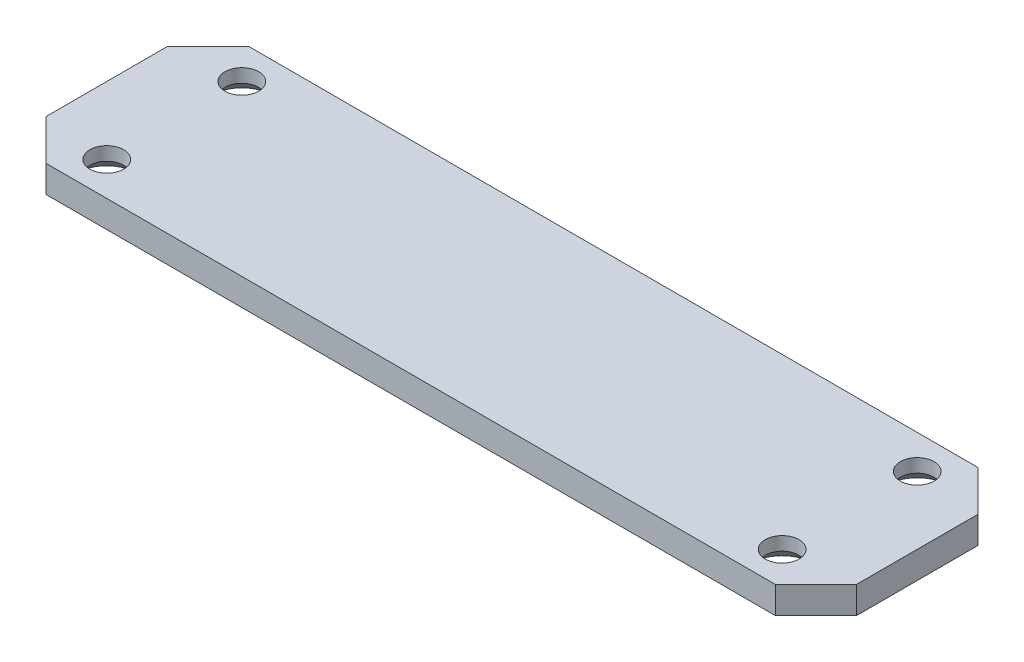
ISO-10303-21;
HEADER;
FILE_DESCRIPTION(('STEP AP214'),'2;1');
FILE_NAME('part.step','',(''),(''),'','','');
FILE_SCHEMA(('AUTOMOTIVE_DESIGN { 1 0 10303 214 1 1 1 1 }'));
ENDSEC;
DATA;
#1=APPLICATION_CONTEXT('core data for automotive mechanical design processes');
#2=APPLICATION_PROTOCOL_DEFINITION('international standard','automotive_design',2000,#1);
#3=PRODUCT_CONTEXT('',#1,'mechanical');
#4=PRODUCT('Part','Part','',(#3));
#5=PRODUCT_RELATED_PRODUCT_CATEGORY('part','',(#4));
#6=PRODUCT_DEFINITION_FORMATION('','',#4);
#7=PRODUCT_DEFINITION_CONTEXT('part definition',#1,'design');
#8=PRODUCT_DEFINITION('design','',#6,#7);
#9=PRODUCT_DEFINITION_SHAPE('','',#8);
#10=(LENGTH_UNIT() NAMED_UNIT(*) SI_UNIT(.MILLI.,.METRE.));
#11=(NAMED_UNIT(*) PLANE_ANGLE_UNIT() SI_UNIT($,.RADIAN.));
#12=(NAMED_UNIT(*) SI_UNIT($,.STERADIAN.) SOLID_ANGLE_UNIT());
#13=UNCERTAINTY_MEASURE_WITH_UNIT(LENGTH_MEASURE(1.E-05),#10,'distance_accuracy_value','');
#14=(GEOMETRIC_REPRESENTATION_CONTEXT(3) GLOBAL_UNCERTAINTY_ASSIGNED_CONTEXT((#13)) GLOBAL_UNIT_ASSIGNED_CONTEXT((#10,
#11,#12)) REPRESENTATION_CONTEXT('',''));
#15=CARTESIAN_POINT('',(0.,0.,0.));
#16=DIRECTION('',(0.,0.,1.));
#17=DIRECTION('',(1.,0.,0.));
#18=AXIS2_PLACEMENT_3D('',#15,#16,#17);
#19=CARTESIAN_POINT('',(-50.,-148.,8.));
#20=DIRECTION('',(0.,1.,0.));
#21=DIRECTION('',(0.,0.,1.));
#22=AXIS2_PLACEMENT_3D('',#19,#20,#21);
#23=CYLINDRICAL_SURFACE('',#22,2.5);
#24=CARTESIAN_POINT('',(-50.,-146.,8.));
#25=DIRECTION('',(0.,1.,0.));
#26=DIRECTION('',(0.,0.,1.));
#27=AXIS2_PLACEMENT_3D('',#24,#25,#26);
#28=CIRCLE('',#27,2.5);
#29=CARTESIAN_POINT('',(-50.,-146.,10.5));
#30=VERTEX_POINT('',#29);
#31=EDGE_CURVE('E11',#30,#30,#28,.F.);
#32=ORIENTED_EDGE('',*,*,#31,.T.);
#33=EDGE_LOOP('',(#32));
#34=FACE_BOUND('',#33,.T.);
#35=CARTESIAN_POINT('',(-50.,-144.,8.));
#36=DIRECTION('',(0.,1.,0.));
#37=DIRECTION('',(0.,0.,1.));
#38=AXIS2_PLACEMENT_3D('',#35,#36,#37);
#39=CIRCLE('',#38,2.5);
#40=CARTESIAN_POINT('',(-50.,-144.,10.5));
#41=VERTEX_POINT('',#40);
#42=EDGE_CURVE('E193',#41,#41,#39,.T.);
#43=ORIENTED_EDGE('',*,*,#42,.T.);
#44=EDGE_LOOP('',(#43));
#45=FACE_BOUND('',#44,.T.);
#46=ADVANCED_FACE('F16',(#34,#45),#23,.F.);
#47=CARTESIAN_POINT('',(50.,-148.,8.));
#48=DIRECTION('',(0.,1.,0.));
#49=DIRECTION('',(0.,0.,1.));
#50=AXIS2_PLACEMENT_3D('',#47,#48,#49);
#51=CYLINDRICAL_SURFACE('',#50,2.5);
#52=CARTESIAN_POINT('',(50.,-146.,8.));
#53=DIRECTION('',(0.,1.,0.));
#54=DIRECTION('',(0.,0.,1.));
#55=AXIS2_PLACEMENT_3D('',#52,#53,#54);
#56=CIRCLE('',#55,2.5);
#57=CARTESIAN_POINT('',(50.,-146.,10.5));
#58=VERTEX_POINT('',#57);
#59=EDGE_CURVE('E25',#58,#58,#56,.F.);
#60=ORIENTED_EDGE('',*,*,#59,.T.);
#61=EDGE_LOOP('',(#60));
#62=FACE_BOUND('',#61,.T.);
#63=CARTESIAN_POINT('',(50.,-144.,8.));
#64=DIRECTION('',(0.,1.,0.));
#65=DIRECTION('',(0.,0.,1.));
#66=AXIS2_PLACEMENT_3D('',#63,#64,#65);
#67=CIRCLE('',#66,2.5);
#68=CARTESIAN_POINT('',(50.,-144.,10.5));
#69=VERTEX_POINT('',#68);
#70=EDGE_CURVE('E196',#69,#69,#67,.T.);
#71=ORIENTED_EDGE('',*,*,#70,.T.);
#72=EDGE_LOOP('',(#71));
#73=FACE_BOUND('',#72,.T.);
#74=ADVANCED_FACE('F147',(#62,#73),#51,.F.);
#75=CARTESIAN_POINT('',(60.,-148.,33.));
#76=DIRECTION('',(0.,1.,0.));
#77=DIRECTION('',(0.,0.,1.));
#78=AXIS2_PLACEMENT_3D('',#75,#76,#77);
#79=PLANE('',#78);
#80=CARTESIAN_POINT('',(-50.,-148.,28.));
#81=DIRECTION('',(0.,1.,0.));
#82=DIRECTION('',(0.,0.,1.));
#83=AXIS2_PLACEMENT_3D('',#80,#81,#82);
#84=CIRCLE('',#83,4.5);
#85=CARTESIAN_POINT('',(-50.,-148.,32.5));
#86=VERTEX_POINT('',#85);
#87=EDGE_CURVE('E139',#86,#86,#84,.T.);
#88=ORIENTED_EDGE('',*,*,#87,.T.);
#89=EDGE_LOOP('',(#88));
#90=FACE_BOUND('',#89,.T.);
#91=CARTESIAN_POINT('',(50.,-148.,28.));
#92=DIRECTION('',(0.,1.,0.));
#93=DIRECTION('',(0.,0.,1.));
#94=AXIS2_PLACEMENT_3D('',#91,#92,#93);
#95=CIRCLE('',#94,4.5);
#96=CARTESIAN_POINT('',(50.,-148.,32.5));
#97=VERTEX_POINT('',#96);
#98=EDGE_CURVE('E136',#97,#97,#95,.T.);
#99=ORIENTED_EDGE('',*,*,#98,.T.);
#100=EDGE_LOOP('',(#99));
#101=FACE_BOUND('',#100,.T.);
#102=CARTESIAN_POINT('',(50.,-148.,8.));
#103=DIRECTION('',(0.,1.,0.));
#104=DIRECTION('',(0.,0.,1.));
#105=AXIS2_PLACEMENT_3D('',#102,#103,#104);
#106=CIRCLE('',#105,4.5);
#107=CARTESIAN_POINT('',(50.,-148.,12.5));
#108=VERTEX_POINT('',#107);
#109=EDGE_CURVE('E133',#108,#108,#106,.T.);
#110=ORIENTED_EDGE('',*,*,#109,.T.);
#111=EDGE_LOOP('',(#110));
#112=FACE_BOUND('',#111,.T.);
#113=CARTESIAN_POINT('',(-50.,-148.,8.));
#114=DIRECTION('',(0.,1.,0.));
#115=DIRECTION('',(0.,0.,1.));
#116=AXIS2_PLACEMENT_3D('',#113,#114,#115);
#117=CIRCLE('',#116,4.5);
#118=CARTESIAN_POINT('',(-50.,-148.,12.5));
#119=VERTEX_POINT('',#118);
#120=EDGE_CURVE('E129',#119,#119,#117,.T.);
#121=ORIENTED_EDGE('',*,*,#120,.T.);
#122=EDGE_LOOP('',(#121));
#123=FACE_BOUND('',#122,.T.);
#124=DIRECTION('',(-1.,0.,0.));
#125=VECTOR('',#124,1.);
#126=CARTESIAN_POINT('',(60.,-148.,3.));
#127=LINE('',#126,#125);
#128=CARTESIAN_POINT('',(54.,-148.,3.));
#129=VERTEX_POINT('',#128);
#130=CARTESIAN_POINT('',(-54.,-148.,3.));
#131=VERTEX_POINT('',#130);
#132=EDGE_CURVE('E163',#129,#131,#127,.T.);
#133=ORIENTED_EDGE('',*,*,#132,.F.);
#134=DIRECTION('',(-0.707106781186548,0.,-0.707106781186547));
#135=VECTOR('',#134,1.);
#136=CARTESIAN_POINT('',(54.,-148.,3.));
#137=LINE('',#136,#135);
#138=CARTESIAN_POINT('',(60.,-148.,9.));
#139=VERTEX_POINT('',#138);
#140=EDGE_CURVE('E164',#129,#139,#137,.F.);
#141=ORIENTED_EDGE('',*,*,#140,.T.);
#142=DIRECTION('',(0.,0.,-1.));
#143=VECTOR('',#142,1.);
#144=CARTESIAN_POINT('',(60.,-148.,33.));
#145=LINE('',#144,#143);
#146=CARTESIAN_POINT('',(60.,-148.,27.));
#147=VERTEX_POINT('',#146);
#148=EDGE_CURVE('E105',#147,#139,#145,.T.);
#149=ORIENTED_EDGE('',*,*,#148,.F.);
#150=DIRECTION('',(0.707106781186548,0.,-0.707106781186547));
#151=VECTOR('',#150,1.);
#152=CARTESIAN_POINT('',(60.,-148.,27.));
#153=LINE('',#152,#151);
#154=CARTESIAN_POINT('',(54.,-148.,33.));
#155=VERTEX_POINT('',#154);
#156=EDGE_CURVE('E178',#147,#155,#153,.F.);
#157=ORIENTED_EDGE('',*,*,#156,.T.);
#158=DIRECTION('',(1.,0.,0.));
#159=VECTOR('',#158,1.);
#160=CARTESIAN_POINT('',(-60.,-148.,33.));
#161=LINE('',#160,#159);
#162=CARTESIAN_POINT('',(-54.,-148.,33.));
#163=VERTEX_POINT('',#162);
#164=EDGE_CURVE('E170',#163,#155,#161,.T.);
#165=ORIENTED_EDGE('',*,*,#164,.F.);
#166=DIRECTION('',(0.707106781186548,0.,0.707106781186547));
#167=VECTOR('',#166,1.);
#168=CARTESIAN_POINT('',(-54.,-148.,33.));
#169=LINE('',#168,#167);
#170=CARTESIAN_POINT('',(-60.,-148.,27.));
#171=VERTEX_POINT('',#170);
#172=EDGE_CURVE('E180',#163,#171,#169,.F.);
#173=ORIENTED_EDGE('',*,*,#172,.T.);
#174=DIRECTION('',(0.,0.,1.));
#175=VECTOR('',#174,1.);
#176=CARTESIAN_POINT('',(-60.,-148.,3.));
#177=LINE('',#176,#175);
#178=CARTESIAN_POINT('',(-60.,-148.,9.));
#179=VERTEX_POINT('',#178);
#180=EDGE_CURVE('E167',#179,#171,#177,.T.);
#181=ORIENTED_EDGE('',*,*,#180,.F.);
#182=DIRECTION('',(-0.707106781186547,0.,0.707106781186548));
#183=VECTOR('',#182,1.);
#184=CARTESIAN_POINT('',(-60.,-148.,9.));
#185=LINE('',#184,#183);
#186=EDGE_CURVE('E61',#179,#131,#185,.F.);
#187=ORIENTED_EDGE('',*,*,#186,.T.);
#188=EDGE_LOOP('',(#133,#141,#149,#157,#165,#173,#181,#187));
#189=FACE_BOUND('',#188,.T.);
#190=ADVANCED_FACE('F156',(#90,#101,#112,#123,#189),#79,.F.);
#191=CARTESIAN_POINT('',(50.,-148.,28.));
#192=DIRECTION('',(0.,1.,0.));
#193=DIRECTION('',(0.,0.,1.));
#194=AXIS2_PLACEMENT_3D('',#191,#192,#193);
#195=CYLINDRICAL_SURFACE('',#194,2.5);
#196=CARTESIAN_POINT('',(50.,-146.,28.));
#197=DIRECTION('',(0.,1.,0.));
#198=DIRECTION('',(0.,0.,1.));
#199=AXIS2_PLACEMENT_3D('',#196,#197,#198);
#200=CIRCLE('',#199,2.5);
#201=CARTESIAN_POINT('',(50.,-146.,30.5));
#202=VERTEX_POINT('',#201);
#203=EDGE_CURVE('E142',#202,#202,#200,.F.);
#204=ORIENTED_EDGE('',*,*,#203,.T.);
#205=EDGE_LOOP('',(#204));
#206=FACE_BOUND('',#205,.T.);
#207=CARTESIAN_POINT('',(50.,-144.,28.));
#208=DIRECTION('',(0.,1.,0.));
#209=DIRECTION('',(0.,0.,1.));
#210=AXIS2_PLACEMENT_3D('',#207,#208,#209);
#211=CIRCLE('',#210,2.5);
#212=CARTESIAN_POINT('',(50.,-144.,30.5));
#213=VERTEX_POINT('',#212);
#214=EDGE_CURVE('E199',#213,#213,#211,.T.);
#215=ORIENTED_EDGE('',*,*,#214,.T.);
#216=EDGE_LOOP('',(#215));
#217=FACE_BOUND('',#216,.T.);
#218=ADVANCED_FACE('F159',(#206,#217),#195,.F.);
#219=CARTESIAN_POINT('',(-60.,-138.,33.));
#220=DIRECTION('',(0.,0.,-1.));
#221=DIRECTION('',(-1.,0.,0.));
#222=AXIS2_PLACEMENT_3D('',#219,#220,#221);
#223=PLANE('',#222);
#224=DIRECTION('',(1.,0.,0.));
#225=VECTOR('',#224,1.);
#226=CARTESIAN_POINT('',(-60.,-144.,33.));
#227=LINE('',#226,#225);
#228=CARTESIAN_POINT('',(-54.,-144.,33.));
#229=VERTEX_POINT('',#228);
#230=CARTESIAN_POINT('',(54.,-144.,33.));
#231=VERTEX_POINT('',#230);
#232=EDGE_CURVE('E113',#229,#231,#227,.T.);
#233=ORIENTED_EDGE('',*,*,#232,.F.);
#234=DIRECTION('',(0.,-1.,0.));
#235=VECTOR('',#234,1.);
#236=CARTESIAN_POINT('',(-54.,-138.,33.));
#237=LINE('',#236,#235);
#238=EDGE_CURVE('E130',#229,#163,#237,.T.);
#239=ORIENTED_EDGE('',*,*,#238,.T.);
#240=ORIENTED_EDGE('',*,*,#164,.T.);
#241=DIRECTION('',(0.,1.,0.));
#242=VECTOR('',#241,1.);
#243=CARTESIAN_POINT('',(54.,-138.,33.));
#244=LINE('',#243,#242);
#245=EDGE_CURVE('E89',#155,#231,#244,.T.);
#246=ORIENTED_EDGE('',*,*,#245,.T.);
#247=EDGE_LOOP('',(#233,#239,#240,#246));
#248=FACE_BOUND('',#247,.T.);
#249=ADVANCED_FACE('F214',(#248),#223,.F.);
#250=CARTESIAN_POINT('',(60.,-138.,33.));
#251=DIRECTION('',(-1.,0.,0.));
#252=DIRECTION('',(0.,0.,1.));
#253=AXIS2_PLACEMENT_3D('',#250,#251,#252);
#254=PLANE('',#253);
#255=ORIENTED_EDGE('',*,*,#148,.T.);
#256=DIRECTION('',(0.,1.,0.));
#257=VECTOR('',#256,1.);
#258=CARTESIAN_POINT('',(60.,-138.,9.));
#259=LINE('',#258,#257);
#260=CARTESIAN_POINT('',(60.,-144.,9.));
#261=VERTEX_POINT('',#260);
#262=EDGE_CURVE('E99',#139,#261,#259,.T.);
#263=ORIENTED_EDGE('',*,*,#262,.T.);
#264=DIRECTION('',(0.,0.,-1.));
#265=VECTOR('',#264,1.);
#266=CARTESIAN_POINT('',(60.,-144.,33.));
#267=LINE('',#266,#265);
#268=CARTESIAN_POINT('',(60.,-144.,27.));
#269=VERTEX_POINT('',#268);
#270=EDGE_CURVE('E102',#269,#261,#267,.T.);
#271=ORIENTED_EDGE('',*,*,#270,.F.);
#272=DIRECTION('',(0.,-1.,0.));
#273=VECTOR('',#272,1.);
#274=CARTESIAN_POINT('',(60.,-138.,27.));
#275=LINE('',#274,#273);
#276=EDGE_CURVE('E108',#269,#147,#275,.T.);
#277=ORIENTED_EDGE('',*,*,#276,.T.);
#278=EDGE_LOOP('',(#255,#263,#271,#277));
#279=FACE_BOUND('',#278,.T.);
#280=ADVANCED_FACE('F100',(#279),#254,.F.);
#281=CARTESIAN_POINT('',(60.,-138.,3.));
#282=DIRECTION('',(0.,0.,1.));
#283=DIRECTION('',(1.,0.,0.));
#284=AXIS2_PLACEMENT_3D('',#281,#282,#283);
#285=PLANE('',#284);
#286=DIRECTION('',(-1.,0.,0.));
#287=VECTOR('',#286,1.);
#288=CARTESIAN_POINT('',(60.,-144.,3.));
#289=LINE('',#288,#287);
#290=CARTESIAN_POINT('',(54.,-144.,3.));
#291=VERTEX_POINT('',#290);
#292=CARTESIAN_POINT('',(-54.,-144.,3.));
#293=VERTEX_POINT('',#292);
#294=EDGE_CURVE('E112',#291,#293,#289,.T.);
#295=ORIENTED_EDGE('',*,*,#294,.F.);
#296=DIRECTION('',(0.,-1.,0.));
#297=VECTOR('',#296,1.);
#298=CARTESIAN_POINT('',(54.,-138.,3.));
#299=LINE('',#298,#297);
#300=EDGE_CURVE('E118',#291,#129,#299,.T.);
#301=ORIENTED_EDGE('',*,*,#300,.T.);
#302=ORIENTED_EDGE('',*,*,#132,.T.);
#303=DIRECTION('',(0.,1.,0.));
#304=VECTOR('',#303,1.);
#305=CARTESIAN_POINT('',(-54.,-138.,3.));
#306=LINE('',#305,#304);
#307=EDGE_CURVE('E174',#131,#293,#306,.T.);
#308=ORIENTED_EDGE('',*,*,#307,.T.);
#309=EDGE_LOOP('',(#295,#301,#302,#308));
#310=FACE_BOUND('',#309,.T.);
#311=ADVANCED_FACE('F263',(#310),#285,.F.);
#312=CARTESIAN_POINT('',(-60.,-138.,3.));
#313=DIRECTION('',(1.,0.,0.));
#314=DIRECTION('',(0.,0.,-1.));
#315=AXIS2_PLACEMENT_3D('',#312,#313,#314);
#316=PLANE('',#315);
#317=DIRECTION('',(0.,0.,1.));
#318=VECTOR('',#317,1.);
#319=CARTESIAN_POINT('',(-60.,-144.,3.));
#320=LINE('',#319,#318);
#321=CARTESIAN_POINT('',(-60.,-144.,9.));
#322=VERTEX_POINT('',#321);
#323=CARTESIAN_POINT('',(-60.,-144.,27.));
#324=VERTEX_POINT('',#323);
#325=EDGE_CURVE('E176',#322,#324,#320,.T.);
#326=ORIENTED_EDGE('',*,*,#325,.F.);
#327=DIRECTION('',(0.,-1.,0.));
#328=VECTOR('',#327,1.);
#329=CARTESIAN_POINT('',(-60.,-138.,9.));
#330=LINE('',#329,#328);
#331=EDGE_CURVE('E121',#322,#179,#330,.T.);
#332=ORIENTED_EDGE('',*,*,#331,.T.);
#333=ORIENTED_EDGE('',*,*,#180,.T.);
#334=DIRECTION('',(0.,1.,0.));
#335=VECTOR('',#334,1.);
#336=CARTESIAN_POINT('',(-60.,-138.,27.));
#337=LINE('',#336,#335);
#338=EDGE_CURVE('E33',#171,#324,#337,.T.);
#339=ORIENTED_EDGE('',*,*,#338,.T.);
#340=EDGE_LOOP('',(#326,#332,#333,#339));
#341=FACE_BOUND('',#340,.T.);
#342=ADVANCED_FACE('F209',(#341),#316,.F.);
#343=CARTESIAN_POINT('',(60.,-144.,33.));
#344=DIRECTION('',(0.,1.,0.));
#345=DIRECTION('',(0.,0.,1.));
#346=AXIS2_PLACEMENT_3D('',#343,#344,#345);
#347=PLANE('',#346);
#348=CARTESIAN_POINT('',(-50.,-144.,28.));
#349=DIRECTION('',(0.,1.,0.));
#350=DIRECTION('',(0.,0.,1.));
#351=AXIS2_PLACEMENT_3D('',#348,#349,#350);
#352=CIRCLE('',#351,2.5);
#353=CARTESIAN_POINT('',(-50.,-144.,30.5));
#354=VERTEX_POINT('',#353);
#355=EDGE_CURVE('E190',#354,#354,#352,.T.);
#356=ORIENTED_EDGE('',*,*,#355,.F.);
#357=EDGE_LOOP('',(#356));
#358=FACE_BOUND('',#357,.T.);
#359=ORIENTED_EDGE('',*,*,#42,.F.);
#360=EDGE_LOOP('',(#359));
#361=FACE_BOUND('',#360,.T.);
#362=ORIENTED_EDGE('',*,*,#70,.F.);
#363=EDGE_LOOP('',(#362));
#364=FACE_BOUND('',#363,.T.);
#365=ORIENTED_EDGE('',*,*,#214,.F.);
#366=EDGE_LOOP('',(#365));
#367=FACE_BOUND('',#366,.T.);
#368=ORIENTED_EDGE('',*,*,#270,.T.);
#369=DIRECTION('',(0.707106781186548,0.,0.707106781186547));
#370=VECTOR('',#369,1.);
#371=CARTESIAN_POINT('',(72.,-144.,21.));
#372=LINE('',#371,#370);
#373=EDGE_CURVE('E52',#261,#291,#372,.F.);
#374=ORIENTED_EDGE('',*,*,#373,.T.);
#375=ORIENTED_EDGE('',*,*,#294,.T.);
#376=DIRECTION('',(0.707106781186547,0.,-0.707106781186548));
#377=VECTOR('',#376,1.);
#378=CARTESIAN_POINT('',(-12.,-144.,-39.));
#379=LINE('',#378,#377);
#380=EDGE_CURVE('E119',#293,#322,#379,.F.);
#381=ORIENTED_EDGE('',*,*,#380,.T.);
#382=ORIENTED_EDGE('',*,*,#325,.T.);
#383=DIRECTION('',(-0.707106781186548,0.,-0.707106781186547));
#384=VECTOR('',#383,1.);
#385=CARTESIAN_POINT('',(3.,-144.,90.));
#386=LINE('',#385,#384);
#387=EDGE_CURVE('E93',#324,#229,#386,.F.);
#388=ORIENTED_EDGE('',*,*,#387,.T.);
#389=ORIENTED_EDGE('',*,*,#232,.T.);
#390=DIRECTION('',(-0.707106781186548,0.,0.707106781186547));
#391=VECTOR('',#390,1.);
#392=CARTESIAN_POINT('',(57.,-144.,30.));
#393=LINE('',#392,#391);
#394=EDGE_CURVE('E107',#231,#269,#393,.F.);
#395=ORIENTED_EDGE('',*,*,#394,.T.);
#396=EDGE_LOOP('',(#368,#374,#375,#381,#382,#388,#389,#395));
#397=FACE_BOUND('',#396,.T.);
#398=ADVANCED_FACE('F110',(#358,#361,#364,#367,#397),#347,.T.);
#399=CARTESIAN_POINT('',(-50.,-148.,28.));
#400=DIRECTION('',(0.,1.,0.));
#401=DIRECTION('',(0.,0.,1.));
#402=AXIS2_PLACEMENT_3D('',#399,#400,#401);
#403=CYLINDRICAL_SURFACE('',#402,2.5);
#404=CARTESIAN_POINT('',(-50.,-146.,28.));
#405=DIRECTION('',(0.,1.,0.));
#406=DIRECTION('',(0.,0.,1.));
#407=AXIS2_PLACEMENT_3D('',#404,#405,#406);
#408=CIRCLE('',#407,2.5);
#409=CARTESIAN_POINT('',(-50.,-146.,30.5));
#410=VERTEX_POINT('',#409);
#411=EDGE_CURVE('E126',#410,#410,#408,.F.);
#412=ORIENTED_EDGE('',*,*,#411,.T.);
#413=EDGE_LOOP('',(#412));
#414=FACE_BOUND('',#413,.T.);
#415=ORIENTED_EDGE('',*,*,#355,.T.);
#416=EDGE_LOOP('',(#415));
#417=FACE_BOUND('',#416,.T.);
#418=ADVANCED_FACE('F240',(#414,#417),#403,.F.);
#419=CARTESIAN_POINT('',(54.,-138.,3.));
#420=DIRECTION('',(-0.707106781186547,0.,0.707106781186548));
#421=DIRECTION('',(0.707106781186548,0.,0.707106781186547));
#422=AXIS2_PLACEMENT_3D('',#419,#420,#421);
#423=PLANE('',#422);
#424=ORIENTED_EDGE('',*,*,#373,.F.);
#425=ORIENTED_EDGE('',*,*,#262,.F.);
#426=ORIENTED_EDGE('',*,*,#140,.F.);
#427=ORIENTED_EDGE('',*,*,#300,.F.);
#428=EDGE_LOOP('',(#424,#425,#426,#427));
#429=FACE_BOUND('',#428,.T.);
#430=ADVANCED_FACE('F116',(#429),#423,.F.);
#431=CARTESIAN_POINT('',(-60.,-138.,9.));
#432=DIRECTION('',(0.707106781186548,0.,0.707106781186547));
#433=DIRECTION('',(0.707106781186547,0.,-0.707106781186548));
#434=AXIS2_PLACEMENT_3D('',#431,#432,#433);
#435=PLANE('',#434);
#436=ORIENTED_EDGE('',*,*,#380,.F.);
#437=ORIENTED_EDGE('',*,*,#307,.F.);
#438=ORIENTED_EDGE('',*,*,#186,.F.);
#439=ORIENTED_EDGE('',*,*,#331,.F.);
#440=EDGE_LOOP('',(#436,#437,#438,#439));
#441=FACE_BOUND('',#440,.T.);
#442=ADVANCED_FACE('F208',(#441),#435,.F.);
#443=CARTESIAN_POINT('',(-54.,-138.,33.));
#444=DIRECTION('',(0.707106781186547,0.,-0.707106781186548));
#445=DIRECTION('',(-0.707106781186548,0.,-0.707106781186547));
#446=AXIS2_PLACEMENT_3D('',#443,#444,#445);
#447=PLANE('',#446);
#448=ORIENTED_EDGE('',*,*,#387,.F.);
#449=ORIENTED_EDGE('',*,*,#338,.F.);
#450=ORIENTED_EDGE('',*,*,#172,.F.);
#451=ORIENTED_EDGE('',*,*,#238,.F.);
#452=EDGE_LOOP('',(#448,#449,#450,#451));
#453=FACE_BOUND('',#452,.T.);
#454=ADVANCED_FACE('F213',(#453),#447,.F.);
#455=CARTESIAN_POINT('',(60.,-138.,27.));
#456=DIRECTION('',(-0.707106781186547,0.,-0.707106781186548));
#457=DIRECTION('',(-0.707106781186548,0.,0.707106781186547));
#458=AXIS2_PLACEMENT_3D('',#455,#456,#457);
#459=PLANE('',#458);
#460=ORIENTED_EDGE('',*,*,#394,.F.);
#461=ORIENTED_EDGE('',*,*,#245,.F.);
#462=ORIENTED_EDGE('',*,*,#156,.F.);
#463=ORIENTED_EDGE('',*,*,#276,.F.);
#464=EDGE_LOOP('',(#460,#461,#462,#463));
#465=FACE_BOUND('',#464,.T.);
#466=ADVANCED_FACE('F216',(#465),#459,.F.);
#467=CARTESIAN_POINT('',(-50.,-146.,28.));
#468=DIRECTION('',(0.,-1.,0.));
#469=DIRECTION('',(0.,0.,-1.));
#470=AXIS2_PLACEMENT_3D('',#467,#468,#469);
#471=CONICAL_SURFACE('',#470,2.5,0.785398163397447);
#472=ORIENTED_EDGE('',*,*,#87,.F.);
#473=EDGE_LOOP('',(#472));
#474=FACE_BOUND('',#473,.T.);
#475=ORIENTED_EDGE('',*,*,#411,.F.);
#476=EDGE_LOOP('',(#475));
#477=FACE_BOUND('',#476,.T.);
#478=ADVANCED_FACE('F218',(#474,#477),#471,.F.);
#479=CARTESIAN_POINT('',(50.,-148.,28.));
#480=DIRECTION('',(0.,-1.,0.));
#481=DIRECTION('',(0.,0.,-1.));
#482=AXIS2_PLACEMENT_3D('',#479,#480,#481);
#483=CONICAL_SURFACE('',#482,4.5,0.785398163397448);
#484=ORIENTED_EDGE('',*,*,#203,.F.);
#485=EDGE_LOOP('',(#484));
#486=FACE_BOUND('',#485,.T.);
#487=ORIENTED_EDGE('',*,*,#98,.F.);
#488=EDGE_LOOP('',(#487));
#489=FACE_BOUND('',#488,.T.);
#490=ADVANCED_FACE('F153',(#486,#489),#483,.F.);
#491=CARTESIAN_POINT('',(50.,-148.,8.));
#492=DIRECTION('',(0.,-1.,0.));
#493=DIRECTION('',(0.,0.,-1.));
#494=AXIS2_PLACEMENT_3D('',#491,#492,#493);
#495=CONICAL_SURFACE('',#494,4.5,0.785398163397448);
#496=ORIENTED_EDGE('',*,*,#59,.F.);
#497=EDGE_LOOP('',(#496));
#498=FACE_BOUND('',#497,.T.);
#499=ORIENTED_EDGE('',*,*,#109,.F.);
#500=EDGE_LOOP('',(#499));
#501=FACE_BOUND('',#500,.T.);
#502=ADVANCED_FACE('F150',(#498,#501),#495,.F.);
#503=CARTESIAN_POINT('',(-50.,-148.,8.));
#504=DIRECTION('',(0.,-1.,0.));
#505=DIRECTION('',(0.,0.,-1.));
#506=AXIS2_PLACEMENT_3D('',#503,#504,#505);
#507=CONICAL_SURFACE('',#506,4.5,0.785398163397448);
#508=ORIENTED_EDGE('',*,*,#31,.F.);
#509=EDGE_LOOP('',(#508));
#510=FACE_BOUND('',#509,.T.);
#511=ORIENTED_EDGE('',*,*,#120,.F.);
#512=EDGE_LOOP('',(#511));
#513=FACE_BOUND('',#512,.T.);
#514=ADVANCED_FACE('F18',(#510,#513),#507,.F.);
#515=CLOSED_SHELL('',(#46,#74,#190,#218,#249,#280,#311,#342,#398,#418,#430,#442,#454,#466,#478,
#490,#502,#514));
#516=MANIFOLD_SOLID_BREP('B1',#515);
#517=ADVANCED_BREP_SHAPE_REPRESENTATION('',(#18,#516),#14);
#518=SHAPE_DEFINITION_REPRESENTATION(#9,#517);
ENDSEC;
END-ISO-10303-21;
